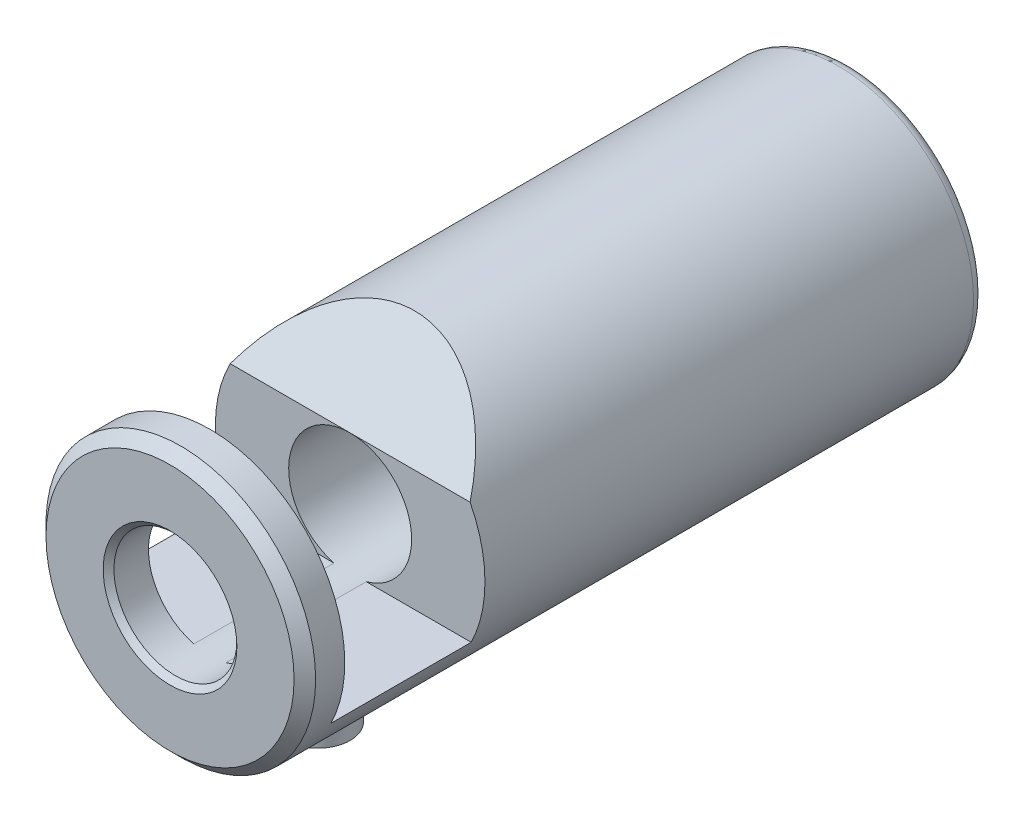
from build123d import *

# Parameters (mm, degrees)
ESQUISSE2_R                               = 6.25
BOSS_EXTRU_1_DEPTH                        = 31.5
CHANFREIN1_SIZE                           = 0.5
CONG_1_R                                  = 0.5
DIAM_TRE_DU_PER_AGE_5_7_5_7_1_D           = 5.7
DIAM_TRE_DU_PER_AGE_5_7_5_7_1_DEPTH       = 27
DIAM_TRE_DU_PER_AGE_5_7_5_7_1_CSINK_D     = 6.2
DIAM_TRE_DU_PER_AGE_5_7_5_7_1_CSINK_ANGLE = 90
DIAM_TRE_DU_PER_AGE_5_7_5_7_1_TIP         = 1.712452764
ENL_V_MAT_EXTRU_1_REACH                   = 34.717
ESQUISSE3_W                               = 15
ESQUISSE3_H                               = 6.5
ENL_V_MAT_EXTRU_1_DIRECTION_2_DEPTH       = 2.75
ESQUISSE7_R                               = 1.5
BOSS_EXTRU_2_DEPTH                        = 1.75
BOSS_EXTRU_2_DIRECTION_2_REACH            = 36.461
BOSS_EXTRU_2_DIRECTION_2_END_RADIUS       = 6.25
ENL_V_MAT_EXTRU_2_REACH                   = 35.096
ENL_V_MAT_EXTRU_2_DIRECTION_2_REACH       = 35.096


with BuildPart() as part:
    # Esquisse2 → Boss.-Extru.1 (new body)
    with BuildSketch(Plane.XY):
        Circle(ESQUISSE2_R)
    extrude(amount=BOSS_EXTRU_1_DEPTH)

    # Chanfrein1
    chanfrein1_edges = [part.edges().sort_by_distance(p)[0] for p in [
        (-6.25, 0, 31.5),
    ]]
    chamfer(chanfrein1_edges, length=CHANFREIN1_SIZE)

    # Cong_1
    cong_1_edges = [part.edges().sort_by_distance(p)[0] for p in [
        (-6.25, 0, 0),
    ]]
    fillet(cong_1_edges, radius=CONG_1_R)

    # Diam_tre du per_age _5.7 _5.7_1
    with Locations(Plane.XY.offset(31.5)):
        with Locations((0, 0)):
            CounterSinkHole(DIAM_TRE_DU_PER_AGE_5_7_5_7_1_D / 2, DIAM_TRE_DU_PER_AGE_5_7_5_7_1_CSINK_D / 2, depth=DIAM_TRE_DU_PER_AGE_5_7_5_7_1_DEPTH, counter_sink_angle=DIAM_TRE_DU_PER_AGE_5_7_5_7_1_CSINK_ANGLE)
            with Locations((0, 0, -(DIAM_TRE_DU_PER_AGE_5_7_5_7_1_DEPTH + DIAM_TRE_DU_PER_AGE_5_7_5_7_1_TIP / 2))):  # 118° drill point
                Cone(0, DIAM_TRE_DU_PER_AGE_5_7_5_7_1_D / 2, DIAM_TRE_DU_PER_AGE_5_7_5_7_1_TIP, mode=Mode.SUBTRACT)

    # Esquisse3 → Enl_v. mat.-Extru.1 (cut, up to next)
    with BuildSketch(Plane(origin=(0, 0, 0), x_dir=(1, 0, 0), z_dir=(0, 1, 0)), mode=Mode.PRIVATE) as enl_v_mat_extru_1_sk1:
        with Locations((0, -26.4)):
            Rectangle(ESQUISSE3_W, ESQUISSE3_H)
    enl_v_mat_extru_1_tool1 = extrude(enl_v_mat_extru_1_sk1.sketch, amount=ENL_V_MAT_EXTRU_1_REACH, mode=Mode.PRIVATE) & part.part
    add(enl_v_mat_extru_1_tool1.solids().sort_by_distance((0, 0, 26.4))[0], mode=Mode.SUBTRACT)

    # Esquisse3 → Enl_v. mat.-Extru.1 direction 2 (cut)
    with BuildSketch(Plane(origin=(0, 0, 0), x_dir=(1, 0, 0), z_dir=(0, 1, 0))):
        with Locations((0, -26.4)):
            Rectangle(ESQUISSE3_W, ESQUISSE3_H)
    extrude(amount=-ENL_V_MAT_EXTRU_1_DIRECTION_2_DEPTH, mode=Mode.SUBTRACT)

    # Esquisse7 → Boss.-Extru.2 (add)
    with BuildSketch(Plane(origin=(0, -6.25, 0), x_dir=(1, 0, 0), z_dir=(0, 1, 0))):
        with Locations(Location((0, -24.65, 0), (0, 0, 270))):
            Circle(ESQUISSE7_R)
    extrude(amount=-BOSS_EXTRU_2_DEPTH)

    # Boss.-Extru.2 direction 2: up to this cylinder (the profile starts outside it)
    boss_extru_2_direction_2_end = Plane(origin=(0, 0, 24.65), z_dir=(0, 0, -1)) * Cylinder(BOSS_EXTRU_2_DIRECTION_2_END_RADIUS, 86.422, mode=Mode.PRIVATE)
    # Esquisse7 → Boss.-Extru.2 direction 2 (add, up to the surface)
    with BuildSketch(Plane(origin=(0, -6.25, 0), x_dir=(1, 0, 0), z_dir=(0, 1, 0)), mode=Mode.PRIVATE) as boss_extru_2_direction_2_sk1:
        with Locations(Location((0, -24.65, 0), (0, 0, 270))):
            Circle(ESQUISSE7_R)
    boss_extru_2_direction_2_tool1 = extrude(boss_extru_2_direction_2_sk1.sketch, amount=BOSS_EXTRU_2_DIRECTION_2_REACH, mode=Mode.PRIVATE) - boss_extru_2_direction_2_end
    add(boss_extru_2_direction_2_tool1.solids().sort_by_distance((0, -6.25, 24.65))[0])
    add(boss_extru_2_direction_2_tool1.solids().sort_by_distance((0, -6.25, 24.65))[1])

    # Esquisse8 → Enl_v. mat.-Extru.2 (cut, up to next)
    with BuildSketch(Plane(origin=(0, 0, 0), x_dir=(0, 0, -1), z_dir=(1, 0, 0)), mode=Mode.PRIVATE) as enl_v_mat_extru_2_sk1:
        Polygon((-23.15, 2.85), (-20.15, 6.25), (-23.15, 6.25), align=None)
    enl_v_mat_extru_2_tool1 = extrude(enl_v_mat_extru_2_sk1.sketch, amount=-ENL_V_MAT_EXTRU_2_REACH, mode=Mode.PRIVATE) & part.part
    add(enl_v_mat_extru_2_tool1.solids().sort_by_distance((0, 5.116667, 22.15))[0], mode=Mode.SUBTRACT)

    # Esquisse8 → Enl_v. mat.-Extru.2 direction 2 (cut, up to next)
    with BuildSketch(Plane(origin=(0, 0, 0), x_dir=(0, 0, -1), z_dir=(1, 0, 0)), mode=Mode.PRIVATE) as enl_v_mat_extru_2_direction_2_sk1:
        Polygon((-23.15, 2.85), (-20.15, 6.25), (-23.15, 6.25), align=None)
    enl_v_mat_extru_2_direction_2_tool1 = extrude(enl_v_mat_extru_2_direction_2_sk1.sketch, amount=ENL_V_MAT_EXTRU_2_DIRECTION_2_REACH, mode=Mode.PRIVATE) & part.part
    add(enl_v_mat_extru_2_direction_2_tool1.solids().sort_by_distance((0, 5.116667, 22.15))[0], mode=Mode.SUBTRACT)


solid = part.part
